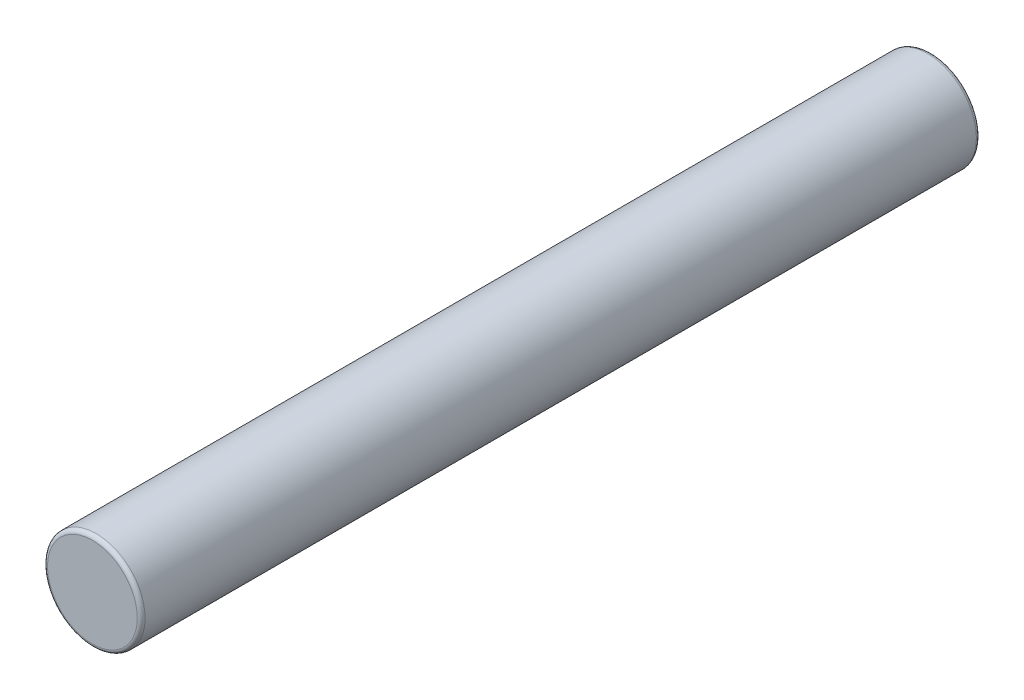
from build123d import *

# Parameters (mm, degrees)
ESQUISSE1_R      = 2.5
EXTRUSION1_DEPTH = 21.5
CONG_1_R         = 0.2


with BuildPart() as part:
    # Esquisse1 → Extrusion1 (new, symmetric)
    with BuildSketch(Plane.XY):
        Circle(ESQUISSE1_R)
    extrude(amount=EXTRUSION1_DEPTH, both=True)

    # Cong_1
    cong_1_edges = [part.edges().sort_by_distance(p)[0] for p in [
        (-2.5, 0, -21.5),
        (-2.5, 0, 21.5),
    ]]
    fillet(cong_1_edges, radius=CONG_1_R)


solid = part.part
